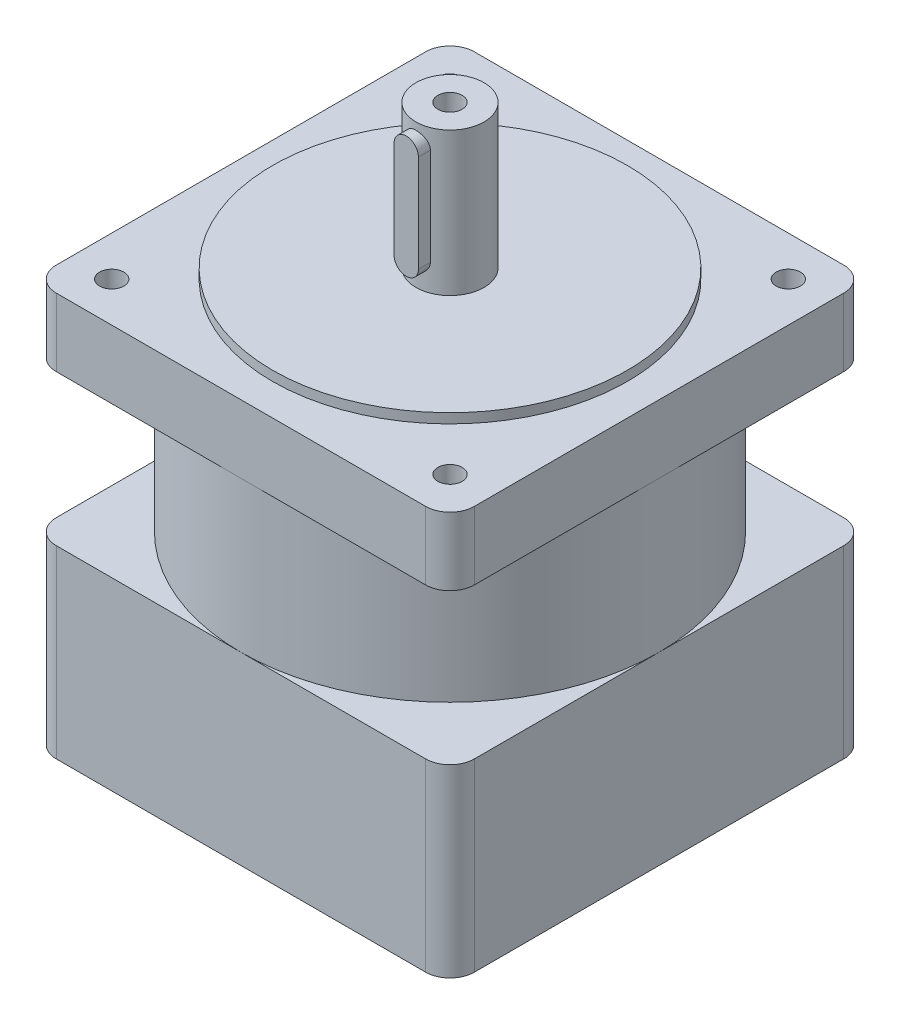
from build123d import *

# Parameters (mm, degrees)
SKETCH_1_W             = 86
SKETCH_1_H             = 86
EXTRUDE_1_DEPTH        = 14
FILLET_1_R             = 5
SKETCH_2_R             = 36.5
EXTRUDE_2_DEPTH        = 2
SKETCH_3_R             = 7
EXTRUDE_3_DEPTH        = 31.5
EXTRUDE_4_DEPTH        = 5
HOLE_WIZARD_M6_1_D     = 5
HOLE_WIZARD_M6_1_DEPTH = 17
HOLE_WIZARD_M6_1_TIP   = 1.502151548
SKETCH_7_R             = 43
EXTRUDE_5_DEPTH        = 31
SKETCH_8_W             = 86
SKETCH_8_H             = 86
EXTRUDE_6_DEPTH        = 38
FILLET_2_R             = 5
SKETCH_9_R             = 36.5
CUT_EXTRUDE_1_DEPTH    = 5
CUT_EXTRUDE_3_DEPTH    = 34
HOLE_WIZARD_M6_2_D     = 5
HOLE_WIZARD_M6_2_DEPTH = 17
HOLE_WIZARD_M6_2_TIP   = 1.502151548
HOLE_WIZARD_M6_3_D     = 5
HOLE_WIZARD_M6_3_DEPTH = 19
HOLE_WIZARD_M6_3_TIP   = 1.502151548


with BuildPart() as part:
    # Sketch 1 → Extrude 1 (new body)
    with BuildSketch(Plane(origin=(0, 0, 0), x_dir=(1, 0, 0), z_dir=(0, 1, 0))):
        Rectangle(SKETCH_1_W, SKETCH_1_H)
    extrude(amount=EXTRUDE_1_DEPTH)

    # Fillet 1
    fillet_1_edges = [part.edges().sort_by_distance(p)[0] for p in [
        (43, 7, 43),
        (-43, 7, 43),
        (-43, 7, -43),
        (43, 7, -43),
    ]]
    fillet(fillet_1_edges, radius=FILLET_1_R)

    # Sketch 2 → Extrude 2 (add)
    with BuildSketch(Plane(origin=(0, 14, 0), x_dir=(1, 0, 0), z_dir=(0, 1, 0))):
        with Locations(Location((0, 0, 0), (0, 0, 270))):
            Circle(SKETCH_2_R)
    extrude(amount=EXTRUDE_2_DEPTH)

    # Sketch 3 → Extrude 3 (add)
    with BuildSketch(Plane(origin=(0, 14, 0), x_dir=(1, 0, 0), z_dir=(0, 1, 0))):
        with Locations(Location((0, 0, 0), (0, 0, 270))):
            Circle(SKETCH_3_R)
    extrude(amount=EXTRUDE_3_DEPTH)

    # Sketch 4 → Extrude 4 (add)
    with BuildSketch(Plane.XY.offset(4)):
        with BuildLine():
            Line((-2.5, 41.5), (-2.5, 21.5))
            ThreePointArc((-2.5, 21.5), (0, 19), (2.5, 21.5))
            Line((2.5, 21.5), (2.5, 41.5))
            ThreePointArc((2.5, 41.5), (0, 44), (-2.5, 41.5))
        make_face()
    extrude(amount=EXTRUDE_4_DEPTH)

    # Hole Wizard M6 _1
    with Locations(Plane(origin=(0, 45.5, 0), x_dir=(1, 0, 0), z_dir=(0, 1, 0))):
        with Locations((0, 0)):
            Hole(HOLE_WIZARD_M6_1_D / 2, depth=HOLE_WIZARD_M6_1_DEPTH)
            with Locations((0, 0, -(HOLE_WIZARD_M6_1_DEPTH + HOLE_WIZARD_M6_1_TIP / 2))):  # 118° drill point
                Cone(0, HOLE_WIZARD_M6_1_D / 2, HOLE_WIZARD_M6_1_TIP, mode=Mode.SUBTRACT)

    # Sketch 7 → Extrude 5 (add)
    with BuildSketch(Plane(origin=(0, 0, 0), x_dir=(1, 0, 0), z_dir=(0, 1, 0))):
        with Locations(Location((0, 0, 0), (0, 0, 270))):
            Circle(SKETCH_7_R)
    extrude(amount=-EXTRUDE_5_DEPTH)

    # Sketch 8 → Extrude 6 (add)
    with BuildSketch(Plane(origin=(0, -31, 0), x_dir=(-1, 0, 0), z_dir=(0, -1, 0))):
        Rectangle(SKETCH_8_W, SKETCH_8_H)
    extrude(amount=EXTRUDE_6_DEPTH)

    # Fillet 2
    fillet_2_edges = [part.edges().sort_by_distance(p)[0] for p in [
        (43, -50, -43),
        (43, -50, 43),
        (-43, -50, 43),
        (-43, -50, -43),
    ]]
    fillet(fillet_2_edges, radius=FILLET_2_R)

    # Sketch 9 → Cut-Extrude 1 (cut)
    with BuildSketch(Plane(origin=(0, -69, 0), x_dir=(-1, 0, 0), z_dir=(0, -1, 0))):
        with Locations(Location((0, 0, 0), (0, 0, 270))):
            Circle(SKETCH_9_R)
    extrude(amount=-CUT_EXTRUDE_1_DEPTH, mode=Mode.SUBTRACT)

    # Sketch 10 → Cut-Extrude 3 (cut)
    with BuildSketch(Plane(origin=(0, -69, 0), x_dir=(-1, 0, 0), z_dir=(0, -1, 0))):
        with BuildLine():
            Line((2.5, -9), (2.5, -6.538348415))
            ThreePointArc((2.5, -6.538348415), (0, 7), (-2.5, -6.538348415))
            Line((-2.5, -6.538348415), (-2.5, -9))
            Line((-2.5, -9), (2.5, -9))
        make_face()
    extrude(amount=-CUT_EXTRUDE_3_DEPTH, mode=Mode.SUBTRACT)

    # Hole Wizard M6 _2
    with Locations(Plane(origin=(0, -69, 0), x_dir=(-1, 0, 0), z_dir=(0, -1, 0))):
        with Locations((34.8, -34.8), (34.8, 34.8), (-34.8, 34.8), (-34.8, -34.8)):
            Hole(HOLE_WIZARD_M6_2_D / 2, depth=HOLE_WIZARD_M6_2_DEPTH)
            with Locations((0, 0, -(HOLE_WIZARD_M6_2_DEPTH + HOLE_WIZARD_M6_2_TIP / 2))):  # 118° drill point
                Cone(0, HOLE_WIZARD_M6_2_D / 2, HOLE_WIZARD_M6_2_TIP, mode=Mode.SUBTRACT)

    # Hole Wizard M6 _3
    with Locations(Plane(origin=(0, 14, 0), x_dir=(1, 0, 0), z_dir=(0, 1, 0))):
        with Locations((-34.8, 34.8), (-34.8, -34.8), (34.8, -34.8), (34.8, 34.8)):
            Hole(HOLE_WIZARD_M6_3_D / 2, depth=HOLE_WIZARD_M6_3_DEPTH)
            with Locations((0, 0, -(HOLE_WIZARD_M6_3_DEPTH + HOLE_WIZARD_M6_3_TIP / 2))):  # 118° drill point
                Cone(0, HOLE_WIZARD_M6_3_D / 2, HOLE_WIZARD_M6_3_TIP, mode=Mode.SUBTRACT)


solid = part.part
